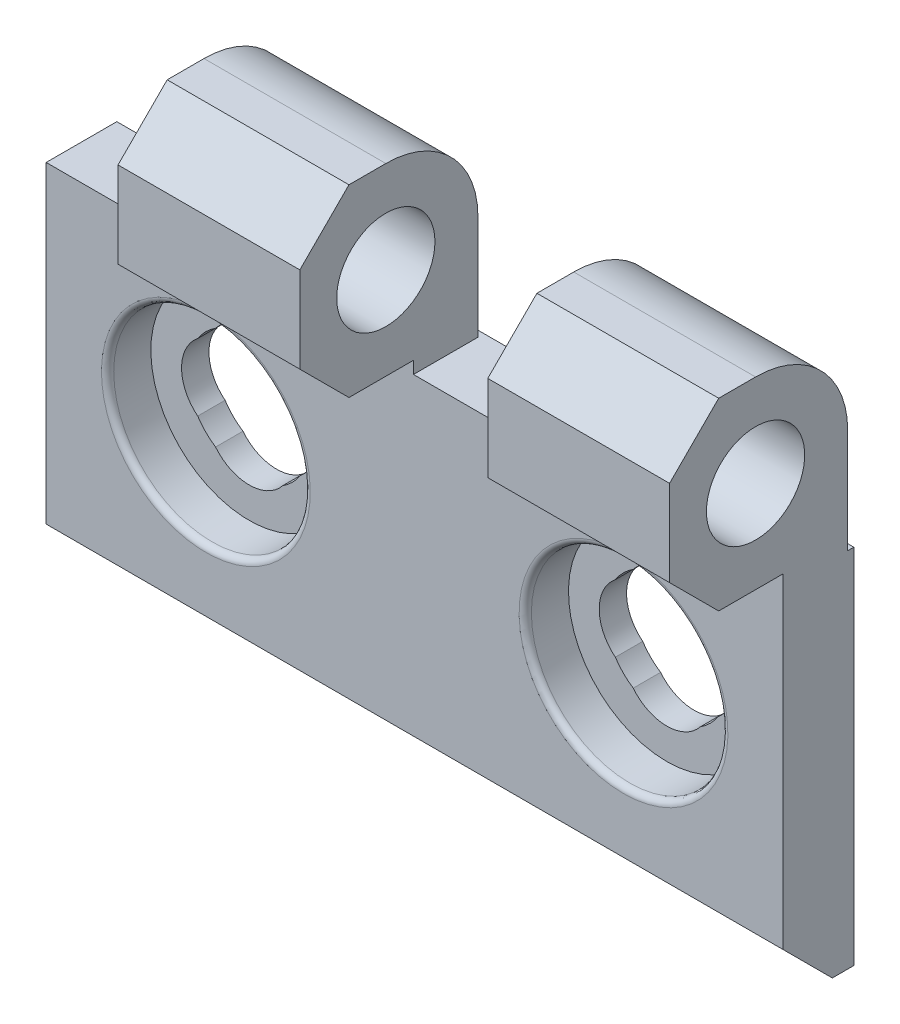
ISO-10303-21;
HEADER;
FILE_DESCRIPTION(('STEP AP214'),'2;1');
FILE_NAME('part.step','',(''),(''),'','','');
FILE_SCHEMA(('AUTOMOTIVE_DESIGN { 1 0 10303 214 1 1 1 1 }'));
ENDSEC;
DATA;
#1=APPLICATION_CONTEXT('core data for automotive mechanical design processes');
#2=APPLICATION_PROTOCOL_DEFINITION('international standard','automotive_design',2000,#1);
#3=PRODUCT_CONTEXT('',#1,'mechanical');
#4=PRODUCT('Part','Part','',(#3));
#5=PRODUCT_RELATED_PRODUCT_CATEGORY('part','',(#4));
#6=PRODUCT_DEFINITION_FORMATION('','',#4);
#7=PRODUCT_DEFINITION_CONTEXT('part definition',#1,'design');
#8=PRODUCT_DEFINITION('design','',#6,#7);
#9=PRODUCT_DEFINITION_SHAPE('','',#8);
#10=(LENGTH_UNIT() NAMED_UNIT(*) SI_UNIT(.MILLI.,.METRE.));
#11=(NAMED_UNIT(*) PLANE_ANGLE_UNIT() SI_UNIT($,.RADIAN.));
#12=(NAMED_UNIT(*) SI_UNIT($,.STERADIAN.) SOLID_ANGLE_UNIT());
#13=UNCERTAINTY_MEASURE_WITH_UNIT(LENGTH_MEASURE(1.E-05),#10,'distance_accuracy_value','');
#14=(GEOMETRIC_REPRESENTATION_CONTEXT(3) GLOBAL_UNCERTAINTY_ASSIGNED_CONTEXT((#13)) GLOBAL_UNIT_ASSIGNED_CONTEXT((#10,
#11,#12)) REPRESENTATION_CONTEXT('',''));
#15=CARTESIAN_POINT('',(0.,0.,0.));
#16=DIRECTION('',(0.,0.,1.));
#17=DIRECTION('',(1.,0.,0.));
#18=AXIS2_PLACEMENT_3D('',#15,#16,#17);
#19=CARTESIAN_POINT('',(0.,0.,5.75));
#20=DIRECTION('',(0.,0.,-1.));
#21=DIRECTION('',(0.,1.,0.));
#22=AXIS2_PLACEMENT_3D('',#19,#20,#21);
#23=CYLINDRICAL_SURFACE('',#22,8.);
#24=CARTESIAN_POINT('',(0.,0.,5.25));
#25=DIRECTION('',(0.,0.,-1.));
#26=DIRECTION('',(1.,0.,0.));
#27=AXIS2_PLACEMENT_3D('',#24,#25,#26);
#28=CIRCLE('',#27,8.);
#29=CARTESIAN_POINT('',(8.,0.,5.25));
#30=VERTEX_POINT('',#29);
#31=EDGE_CURVE('E389',#30,#30,#28,.T.);
#32=ORIENTED_EDGE('',*,*,#31,.F.);
#33=EDGE_LOOP('',(#32));
#34=FACE_BOUND('',#33,.T.);
#35=CARTESIAN_POINT('',(0.,0.,2.22870985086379));
#36=DIRECTION('',(0.,0.,-1.));
#37=DIRECTION('',(0.,1.,0.));
#38=AXIS2_PLACEMENT_3D('',#35,#36,#37);
#39=CIRCLE('',#38,8.);
#40=CARTESIAN_POINT('',(0.,8.,2.22870985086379));
#41=VERTEX_POINT('',#40);
#42=EDGE_CURVE('E18',#41,#41,#39,.F.);
#43=ORIENTED_EDGE('',*,*,#42,.F.);
#44=EDGE_LOOP('',(#43));
#45=FACE_BOUND('',#44,.T.);
#46=ADVANCED_FACE('F14',(#34,#45),#23,.F.);
#47=CARTESIAN_POINT('',(34.,0.,5.75));
#48=DIRECTION('',(0.,0.,1.));
#49=DIRECTION('',(0.,-1.,0.));
#50=AXIS2_PLACEMENT_3D('',#47,#48,#49);
#51=CYLINDRICAL_SURFACE('',#50,8.);
#52=CARTESIAN_POINT('',(34.,0.,5.25));
#53=DIRECTION('',(0.,0.,-1.));
#54=DIRECTION('',(0.,1.,0.));
#55=AXIS2_PLACEMENT_3D('',#52,#53,#54);
#56=CIRCLE('',#55,8.);
#57=CARTESIAN_POINT('',(34.,8.,5.25));
#58=VERTEX_POINT('',#57);
#59=EDGE_CURVE('E421',#58,#58,#56,.T.);
#60=ORIENTED_EDGE('',*,*,#59,.F.);
#61=EDGE_LOOP('',(#60));
#62=FACE_BOUND('',#61,.T.);
#63=CARTESIAN_POINT('',(34.,0.,2.22870985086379));
#64=DIRECTION('',(0.,0.,1.));
#65=DIRECTION('',(0.,-1.,0.));
#66=AXIS2_PLACEMENT_3D('',#63,#64,#65);
#67=CIRCLE('',#66,8.);
#68=CARTESIAN_POINT('',(34.,-8.,2.22870985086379));
#69=VERTEX_POINT('',#68);
#70=EDGE_CURVE('E267',#69,#69,#67,.T.);
#71=ORIENTED_EDGE('',*,*,#70,.F.);
#72=EDGE_LOOP('',(#71));
#73=FACE_BOUND('',#72,.T.);
#74=ADVANCED_FACE('F570',(#62,#73),#51,.F.);
#75=CARTESIAN_POINT('',(-13.,21.,8.));
#76=DIRECTION('',(1.,0.,0.));
#77=DIRECTION('',(0.,0.,1.));
#78=AXIS2_PLACEMENT_3D('',#75,#76,#77);
#79=CYLINDRICAL_SURFACE('',#78,7.5);
#80=DIRECTION('',(1.,0.,0.));
#81=VECTOR('',#80,1.);
#82=CARTESIAN_POINT('',(-13.,21.,0.5));
#83=LINE('',#82,#81);
#84=CARTESIAN_POINT('',(2.1,21.,0.5));
#85=VERTEX_POINT('',#84);
#86=CARTESIAN_POINT('',(16.9,21.,0.5));
#87=VERTEX_POINT('',#86);
#88=EDGE_CURVE('E245',#85,#87,#83,.T.);
#89=ORIENTED_EDGE('',*,*,#88,.F.);
#90=CARTESIAN_POINT('',(2.1,21.,8.));
#91=DIRECTION('',(1.,0.,0.));
#92=DIRECTION('',(0.,0.,1.));
#93=AXIS2_PLACEMENT_3D('',#90,#91,#92);
#94=CIRCLE('',#93,7.5);
#95=CARTESIAN_POINT('',(2.1,28.5,8.));
#96=VERTEX_POINT('',#95);
#97=EDGE_CURVE('E248',#85,#96,#94,.T.);
#98=ORIENTED_EDGE('',*,*,#97,.T.);
#99=DIRECTION('',(1.,0.,0.));
#100=VECTOR('',#99,1.);
#101=CARTESIAN_POINT('',(-13.,28.5,8.));
#102=LINE('',#101,#100);
#103=CARTESIAN_POINT('',(16.9,28.5,8.));
#104=VERTEX_POINT('',#103);
#105=EDGE_CURVE('E387',#104,#96,#102,.F.);
#106=ORIENTED_EDGE('',*,*,#105,.F.);
#107=CARTESIAN_POINT('',(16.9,21.,8.));
#108=DIRECTION('',(1.,0.,0.));
#109=DIRECTION('',(0.,0.,1.));
#110=AXIS2_PLACEMENT_3D('',#107,#108,#109);
#111=CIRCLE('',#110,7.5);
#112=EDGE_CURVE('E251',#104,#87,#111,.F.);
#113=ORIENTED_EDGE('',*,*,#112,.T.);
#114=EDGE_LOOP('',(#89,#98,#106,#113));
#115=FACE_BOUND('',#114,.T.);
#116=ADVANCED_FACE('F247',(#115),#79,.T.);
#117=CARTESIAN_POINT('',(-13.,13.5,11.));
#118=DIRECTION('',(0.,-0.707106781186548,0.707106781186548));
#119=DIRECTION('',(0.,-0.707106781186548,-0.707106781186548));
#120=AXIS2_PLACEMENT_3D('',#117,#118,#119);
#121=PLANE('',#120);
#122=DIRECTION('',(1.,0.,0.));
#123=VECTOR('',#122,1.);
#124=CARTESIAN_POINT('',(-13.,17.5,15.));
#125=LINE('',#124,#123);
#126=CARTESIAN_POINT('',(2.1,17.5,15.));
#127=VERTEX_POINT('',#126);
#128=CARTESIAN_POINT('',(16.9,17.5,15.));
#129=VERTEX_POINT('',#128);
#130=EDGE_CURVE('E404',#127,#129,#125,.T.);
#131=ORIENTED_EDGE('',*,*,#130,.F.);
#132=DIRECTION('',(0.,-0.707106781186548,-0.707106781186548));
#133=VECTOR('',#132,1.);
#134=CARTESIAN_POINT('',(2.1,17.5,15.));
#135=LINE('',#134,#133);
#136=CARTESIAN_POINT('',(2.1,13.5,11.));
#137=VERTEX_POINT('',#136);
#138=EDGE_CURVE('E306',#127,#137,#135,.T.);
#139=ORIENTED_EDGE('',*,*,#138,.T.);
#140=DIRECTION('',(1.,0.,0.));
#141=VECTOR('',#140,1.);
#142=CARTESIAN_POINT('',(-13.,13.5,11.));
#143=LINE('',#142,#141);
#144=CARTESIAN_POINT('',(16.9,13.5,11.));
#145=VERTEX_POINT('',#144);
#146=EDGE_CURVE('E418',#145,#137,#143,.F.);
#147=ORIENTED_EDGE('',*,*,#146,.F.);
#148=DIRECTION('',(0.,0.707106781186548,0.707106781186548));
#149=VECTOR('',#148,1.);
#150=CARTESIAN_POINT('',(16.9,13.5,11.));
#151=LINE('',#150,#149);
#152=EDGE_CURVE('E317',#145,#129,#151,.T.);
#153=ORIENTED_EDGE('',*,*,#152,.T.);
#154=EDGE_LOOP('',(#131,#139,#147,#153));
#155=FACE_BOUND('',#154,.T.);
#156=ADVANCED_FACE('F746',(#155),#121,.T.);
#157=CARTESIAN_POINT('',(-13.,28.5,15.));
#158=DIRECTION('',(0.,0.,1.));
#159=DIRECTION('',(0.,-1.,0.));
#160=AXIS2_PLACEMENT_3D('',#157,#158,#159);
#161=PLANE('',#160);
#162=DIRECTION('',(1.,0.,0.));
#163=VECTOR('',#162,1.);
#164=CARTESIAN_POINT('',(-13.,24.5,15.));
#165=LINE('',#164,#163);
#166=CARTESIAN_POINT('',(2.1,24.5,15.));
#167=VERTEX_POINT('',#166);
#168=CARTESIAN_POINT('',(16.9,24.5,15.));
#169=VERTEX_POINT('',#168);
#170=EDGE_CURVE('E393',#167,#169,#165,.T.);
#171=ORIENTED_EDGE('',*,*,#170,.F.);
#172=DIRECTION('',(0.,-1.,0.));
#173=VECTOR('',#172,1.);
#174=CARTESIAN_POINT('',(2.1,12.5,15.));
#175=LINE('',#174,#173);
#176=EDGE_CURVE('E425',#167,#127,#175,.T.);
#177=ORIENTED_EDGE('',*,*,#176,.T.);
#178=ORIENTED_EDGE('',*,*,#130,.T.);
#179=DIRECTION('',(0.,-1.,0.));
#180=VECTOR('',#179,1.);
#181=CARTESIAN_POINT('',(16.9,28.5,15.));
#182=LINE('',#181,#180);
#183=EDGE_CURVE('E399',#129,#169,#182,.F.);
#184=ORIENTED_EDGE('',*,*,#183,.T.);
#185=EDGE_LOOP('',(#171,#177,#178,#184));
#186=FACE_BOUND('',#185,.T.);
#187=ADVANCED_FACE('F742',(#186),#161,.T.);
#188=CARTESIAN_POINT('',(-13.,24.5,15.));
#189=DIRECTION('',(0.,0.707106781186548,0.707106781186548));
#190=DIRECTION('',(0.,-0.707106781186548,0.707106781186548));
#191=AXIS2_PLACEMENT_3D('',#188,#189,#190);
#192=PLANE('',#191);
#193=DIRECTION('',(1.,0.,0.));
#194=VECTOR('',#193,1.);
#195=CARTESIAN_POINT('',(-13.,28.5,11.));
#196=LINE('',#195,#194);
#197=CARTESIAN_POINT('',(2.1,28.5,11.));
#198=VERTEX_POINT('',#197);
#199=CARTESIAN_POINT('',(16.9,28.5,11.));
#200=VERTEX_POINT('',#199);
#201=EDGE_CURVE('E390',#198,#200,#196,.T.);
#202=ORIENTED_EDGE('',*,*,#201,.F.);
#203=DIRECTION('',(0.,-0.707106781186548,0.707106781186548));
#204=VECTOR('',#203,1.);
#205=CARTESIAN_POINT('',(2.1,28.5,11.));
#206=LINE('',#205,#204);
#207=EDGE_CURVE('E288',#198,#167,#206,.T.);
#208=ORIENTED_EDGE('',*,*,#207,.T.);
#209=ORIENTED_EDGE('',*,*,#170,.T.);
#210=DIRECTION('',(0.,0.707106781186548,-0.707106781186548));
#211=VECTOR('',#210,1.);
#212=CARTESIAN_POINT('',(16.9,24.5,15.));
#213=LINE('',#212,#211);
#214=EDGE_CURVE('E396',#169,#200,#213,.T.);
#215=ORIENTED_EDGE('',*,*,#214,.T.);
#216=EDGE_LOOP('',(#202,#208,#209,#215));
#217=FACE_BOUND('',#216,.T.);
#218=ADVANCED_FACE('F738',(#217),#192,.T.);
#219=CARTESIAN_POINT('',(-13.,28.5,8.));
#220=DIRECTION('',(0.,1.,0.));
#221=DIRECTION('',(0.,0.,1.));
#222=AXIS2_PLACEMENT_3D('',#219,#220,#221);
#223=PLANE('',#222);
#224=ORIENTED_EDGE('',*,*,#105,.T.);
#225=DIRECTION('',(0.,0.,1.));
#226=VECTOR('',#225,1.);
#227=CARTESIAN_POINT('',(2.1,28.5,16.5));
#228=LINE('',#227,#226);
#229=EDGE_CURVE('E266',#96,#198,#228,.T.);
#230=ORIENTED_EDGE('',*,*,#229,.T.);
#231=ORIENTED_EDGE('',*,*,#201,.T.);
#232=DIRECTION('',(0.,0.,-1.));
#233=VECTOR('',#232,1.);
#234=CARTESIAN_POINT('',(16.9,28.5,16.5));
#235=LINE('',#234,#233);
#236=EDGE_CURVE('E398',#200,#104,#235,.T.);
#237=ORIENTED_EDGE('',*,*,#236,.T.);
#238=EDGE_LOOP('',(#224,#230,#231,#237));
#239=FACE_BOUND('',#238,.T.);
#240=ADVANCED_FACE('F734',(#239),#223,.T.);
#241=CARTESIAN_POINT('',(0.,0.,5.25));
#242=DIRECTION('',(0.,0.,-1.));
#243=DIRECTION('',(0.,1.,0.));
#244=AXIS2_PLACEMENT_3D('',#241,#242,#243);
#245=TOROIDAL_SURFACE('',#244,8.5,0.5);
#246=CARTESIAN_POINT('',(0.,0.,5.7499999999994));
#247=DIRECTION('',(0.,0.,-1.));
#248=DIRECTION('',(0.,1.,0.));
#249=AXIS2_PLACEMENT_3D('',#246,#247,#248);
#250=CIRCLE('',#249,8.499999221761);
#251=CARTESIAN_POINT('',(0.,8.499999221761,5.7499999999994));
#252=VERTEX_POINT('',#251);
#253=EDGE_CURVE('E329',#252,#252,#250,.T.);
#254=ORIENTED_EDGE('',*,*,#253,.F.);
#255=EDGE_LOOP('',(#254));
#256=FACE_BOUND('',#255,.T.);
#257=ORIENTED_EDGE('',*,*,#31,.T.);
#258=EDGE_LOOP('',(#257));
#259=FACE_BOUND('',#258,.T.);
#260=ADVANCED_FACE('F737',(#256,#259),#245,.T.);
#261=CARTESIAN_POINT('',(34.,0.,5.25));
#262=DIRECTION('',(0.,0.,1.));
#263=DIRECTION('',(0.,-1.,0.));
#264=AXIS2_PLACEMENT_3D('',#261,#262,#263);
#265=TOROIDAL_SURFACE('',#264,8.5,0.5);
#266=CARTESIAN_POINT('',(34.,0.,5.7499999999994));
#267=DIRECTION('',(0.,0.,1.));
#268=DIRECTION('',(0.,-1.,0.));
#269=AXIS2_PLACEMENT_3D('',#266,#267,#268);
#270=CIRCLE('',#269,8.499999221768);
#271=CARTESIAN_POINT('',(34.,-8.499999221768,5.7499999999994));
#272=VERTEX_POINT('',#271);
#273=EDGE_CURVE('E324',#272,#272,#270,.F.);
#274=ORIENTED_EDGE('',*,*,#273,.F.);
#275=EDGE_LOOP('',(#274));
#276=FACE_BOUND('',#275,.T.);
#277=ORIENTED_EDGE('',*,*,#59,.T.);
#278=EDGE_LOOP('',(#277));
#279=FACE_BOUND('',#278,.T.);
#280=ADVANCED_FACE('F16',(#276,#279),#265,.T.);
#281=CARTESIAN_POINT('',(-13.,13.5,15.));
#282=DIRECTION('',(0.,-1.,0.));
#283=DIRECTION('',(0.,0.,-1.));
#284=AXIS2_PLACEMENT_3D('',#281,#282,#283);
#285=PLANE('',#284);
#286=ORIENTED_EDGE('',*,*,#146,.T.);
#287=DIRECTION('',(0.,0.,1.));
#288=VECTOR('',#287,1.);
#289=CARTESIAN_POINT('',(2.1,13.5,16.5));
#290=LINE('',#289,#288);
#291=CARTESIAN_POINT('',(2.1,13.5,5.75));
#292=VERTEX_POINT('',#291);
#293=EDGE_CURVE('E256',#137,#292,#290,.F.);
#294=ORIENTED_EDGE('',*,*,#293,.T.);
#295=DIRECTION('',(1.,0.,0.));
#296=VECTOR('',#295,1.);
#297=CARTESIAN_POINT('',(-13.,13.5,5.75));
#298=LINE('',#297,#296);
#299=CARTESIAN_POINT('',(16.9,13.5,5.75));
#300=VERTEX_POINT('',#299);
#301=EDGE_CURVE('E295',#300,#292,#298,.F.);
#302=ORIENTED_EDGE('',*,*,#301,.F.);
#303=DIRECTION('',(0.,0.,-1.));
#304=VECTOR('',#303,1.);
#305=CARTESIAN_POINT('',(16.9,13.5,16.5));
#306=LINE('',#305,#304);
#307=EDGE_CURVE('E314',#300,#145,#306,.F.);
#308=ORIENTED_EDGE('',*,*,#307,.T.);
#309=EDGE_LOOP('',(#286,#294,#302,#308));
#310=FACE_BOUND('',#309,.T.);
#311=ADVANCED_FACE('F730',(#310),#285,.T.);
#312=CARTESIAN_POINT('',(0.,0.,2.22870985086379));
#313=DIRECTION('',(0.,0.,1.));
#314=DIRECTION('',(0.,-1.,0.));
#315=AXIS2_PLACEMENT_3D('',#312,#313,#314);
#316=PLANE('',#315);
#317=ORIENTED_EDGE('',*,*,#42,.T.);
#318=EDGE_LOOP('',(#317));
#319=FACE_BOUND('',#318,.T.);
#320=CARTESIAN_POINT('',(2.,0.,2.22870985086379));
#321=DIRECTION('',(0.,0.,-1.));
#322=DIRECTION('',(0.,1.,0.));
#323=AXIS2_PLACEMENT_3D('',#320,#321,#322);
#324=CIRCLE('',#323,3.5);
#325=CARTESIAN_POINT('',(4.1875,2.7321866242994,2.22870985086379));
#326=VERTEX_POINT('',#325);
#327=CARTESIAN_POINT('',(4.1875,-2.7321866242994,2.22870985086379));
#328=VERTEX_POINT('',#327);
#329=EDGE_CURVE('E544',#326,#328,#324,.T.);
#330=ORIENTED_EDGE('',*,*,#329,.T.);
#331=CARTESIAN_POINT('',(0.,0.,2.22870985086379));
#332=DIRECTION('',(0.,0.,1.));
#333=DIRECTION('',(0.,-1.,0.));
#334=AXIS2_PLACEMENT_3D('',#331,#332,#333);
#335=CIRCLE('',#334,5.);
#336=CARTESIAN_POINT('',(2.73218662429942,-4.1875,2.22870985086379));
#337=VERTEX_POINT('',#336);
#338=EDGE_CURVE('E548',#328,#337,#335,.F.);
#339=ORIENTED_EDGE('',*,*,#338,.T.);
#340=CARTESIAN_POINT('',(0.,-2.,2.22870985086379));
#341=DIRECTION('',(0.,0.,-1.));
#342=DIRECTION('',(0.,1.,0.));
#343=AXIS2_PLACEMENT_3D('',#340,#341,#342);
#344=CIRCLE('',#343,3.5);
#345=CARTESIAN_POINT('',(-2.7321866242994,-4.1875,2.22870985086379));
#346=VERTEX_POINT('',#345);
#347=EDGE_CURVE('E552',#337,#346,#344,.T.);
#348=ORIENTED_EDGE('',*,*,#347,.T.);
#349=CARTESIAN_POINT('',(0.,0.,2.22870985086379));
#350=DIRECTION('',(0.,0.,1.));
#351=DIRECTION('',(0.,-1.,0.));
#352=AXIS2_PLACEMENT_3D('',#349,#350,#351);
#353=CIRCLE('',#352,5.);
#354=CARTESIAN_POINT('',(-4.1875,-2.7321866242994,2.22870985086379));
#355=VERTEX_POINT('',#354);
#356=EDGE_CURVE('E524',#346,#355,#353,.F.);
#357=ORIENTED_EDGE('',*,*,#356,.T.);
#358=CARTESIAN_POINT('',(-2.,0.,2.22870985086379));
#359=DIRECTION('',(0.,0.,-1.));
#360=DIRECTION('',(0.,1.,0.));
#361=AXIS2_PLACEMENT_3D('',#358,#359,#360);
#362=CIRCLE('',#361,3.5);
#363=CARTESIAN_POINT('',(-4.1875,2.73218662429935,2.22870985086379));
#364=VERTEX_POINT('',#363);
#365=EDGE_CURVE('E528',#355,#364,#362,.T.);
#366=ORIENTED_EDGE('',*,*,#365,.T.);
#367=CARTESIAN_POINT('',(0.,0.,2.22870985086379));
#368=DIRECTION('',(0.,0.,1.));
#369=DIRECTION('',(0.,-1.,0.));
#370=AXIS2_PLACEMENT_3D('',#367,#368,#369);
#371=CIRCLE('',#370,5.);
#372=CARTESIAN_POINT('',(-2.7321866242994,4.1875,2.22870985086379));
#373=VERTEX_POINT('',#372);
#374=EDGE_CURVE('E533',#364,#373,#371,.F.);
#375=ORIENTED_EDGE('',*,*,#374,.T.);
#376=CARTESIAN_POINT('',(0.,2.,2.22870985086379));
#377=DIRECTION('',(0.,0.,-1.));
#378=DIRECTION('',(0.,1.,0.));
#379=AXIS2_PLACEMENT_3D('',#376,#377,#378);
#380=CIRCLE('',#379,3.5);
#381=CARTESIAN_POINT('',(2.73218662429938,4.1875,2.22870985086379));
#382=VERTEX_POINT('',#381);
#383=EDGE_CURVE('E537',#373,#382,#380,.T.);
#384=ORIENTED_EDGE('',*,*,#383,.T.);
#385=CARTESIAN_POINT('',(0.,0.,2.22870985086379));
#386=DIRECTION('',(0.,0.,1.));
#387=DIRECTION('',(0.,-1.,0.));
#388=AXIS2_PLACEMENT_3D('',#385,#386,#387);
#389=CIRCLE('',#388,5.);
#390=EDGE_CURVE('E540',#382,#326,#389,.F.);
#391=ORIENTED_EDGE('',*,*,#390,.T.);
#392=EDGE_LOOP('',(#330,#339,#348,#357,#366,#375,#384,#391));
#393=FACE_BOUND('',#392,.T.);
#394=ADVANCED_FACE('F566',(#319,#393),#316,.T.);
#395=CARTESIAN_POINT('',(34.,0.,2.22870985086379));
#396=DIRECTION('',(0.,0.,1.));
#397=DIRECTION('',(0.,-1.,0.));
#398=AXIS2_PLACEMENT_3D('',#395,#396,#397);
#399=PLANE('',#398);
#400=CARTESIAN_POINT('',(34.,2.,2.22870985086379));
#401=DIRECTION('',(0.,0.,1.));
#402=DIRECTION('',(0.,-1.,0.));
#403=AXIS2_PLACEMENT_3D('',#400,#401,#402);
#404=CIRCLE('',#403,3.5);
#405=CARTESIAN_POINT('',(31.2678133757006,4.1875,2.22870985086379));
#406=VERTEX_POINT('',#405);
#407=CARTESIAN_POINT('',(36.7321866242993,4.1875,2.22870985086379));
#408=VERTEX_POINT('',#407);
#409=EDGE_CURVE('E506',#406,#408,#404,.F.);
#410=ORIENTED_EDGE('',*,*,#409,.T.);
#411=CARTESIAN_POINT('',(34.,0.,2.22870985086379));
#412=DIRECTION('',(0.,0.,1.));
#413=DIRECTION('',(0.,-1.,0.));
#414=AXIS2_PLACEMENT_3D('',#411,#412,#413);
#415=CIRCLE('',#414,5.);
#416=CARTESIAN_POINT('',(38.1875,2.7321866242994,2.22870985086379));
#417=VERTEX_POINT('',#416);
#418=EDGE_CURVE('E510',#408,#417,#415,.F.);
#419=ORIENTED_EDGE('',*,*,#418,.T.);
#420=CARTESIAN_POINT('',(36.,0.,2.22870985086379));
#421=DIRECTION('',(0.,0.,1.));
#422=DIRECTION('',(0.,-1.,0.));
#423=AXIS2_PLACEMENT_3D('',#420,#421,#422);
#424=CIRCLE('',#423,3.5);
#425=CARTESIAN_POINT('',(38.1875,-2.7321866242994,2.22870985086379));
#426=VERTEX_POINT('',#425);
#427=EDGE_CURVE('E514',#417,#426,#424,.F.);
#428=ORIENTED_EDGE('',*,*,#427,.T.);
#429=CARTESIAN_POINT('',(34.,0.,2.22870985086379));
#430=DIRECTION('',(0.,0.,1.));
#431=DIRECTION('',(0.,-1.,0.));
#432=AXIS2_PLACEMENT_3D('',#429,#430,#431);
#433=CIRCLE('',#432,5.);
#434=CARTESIAN_POINT('',(36.7321866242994,-4.1875,2.22870985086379));
#435=VERTEX_POINT('',#434);
#436=EDGE_CURVE('E518',#426,#435,#433,.F.);
#437=ORIENTED_EDGE('',*,*,#436,.T.);
#438=CARTESIAN_POINT('',(34.,-2.,2.22870985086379));
#439=DIRECTION('',(0.,0.,1.));
#440=DIRECTION('',(0.,-1.,0.));
#441=AXIS2_PLACEMENT_3D('',#438,#439,#440);
#442=CIRCLE('',#441,3.5);
#443=CARTESIAN_POINT('',(31.2678133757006,-4.1875,2.22870985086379));
#444=VERTEX_POINT('',#443);
#445=EDGE_CURVE('E522',#435,#444,#442,.F.);
#446=ORIENTED_EDGE('',*,*,#445,.T.);
#447=CARTESIAN_POINT('',(34.,0.,2.22870985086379));
#448=DIRECTION('',(0.,0.,1.));
#449=DIRECTION('',(0.,-1.,0.));
#450=AXIS2_PLACEMENT_3D('',#447,#448,#449);
#451=CIRCLE('',#450,5.);
#452=CARTESIAN_POINT('',(29.8125,-2.73218662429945,2.22870985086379));
#453=VERTEX_POINT('',#452);
#454=EDGE_CURVE('E492',#444,#453,#451,.F.);
#455=ORIENTED_EDGE('',*,*,#454,.T.);
#456=CARTESIAN_POINT('',(32.,0.,2.22870985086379));
#457=DIRECTION('',(0.,0.,1.));
#458=DIRECTION('',(0.,-1.,0.));
#459=AXIS2_PLACEMENT_3D('',#456,#457,#458);
#460=CIRCLE('',#459,3.5);
#461=CARTESIAN_POINT('',(29.8125,2.73218662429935,2.22870985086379));
#462=VERTEX_POINT('',#461);
#463=EDGE_CURVE('E497',#453,#462,#460,.F.);
#464=ORIENTED_EDGE('',*,*,#463,.T.);
#465=CARTESIAN_POINT('',(34.,0.,2.22870985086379));
#466=DIRECTION('',(0.,0.,1.));
#467=DIRECTION('',(0.,-1.,0.));
#468=AXIS2_PLACEMENT_3D('',#465,#466,#467);
#469=CIRCLE('',#468,5.);
#470=EDGE_CURVE('E502',#462,#406,#469,.F.);
#471=ORIENTED_EDGE('',*,*,#470,.T.);
#472=EDGE_LOOP('',(#410,#419,#428,#437,#446,#455,#464,#471));
#473=FACE_BOUND('',#472,.T.);
#474=ORIENTED_EDGE('',*,*,#70,.T.);
#475=EDGE_LOOP('',(#474));
#476=FACE_BOUND('',#475,.T.);
#477=ADVANCED_FACE('F724',(#473,#476),#399,.T.);
#478=CARTESIAN_POINT('',(2.1,12.5,16.5));
#479=DIRECTION('',(1.,0.,0.));
#480=DIRECTION('',(0.,0.,1.));
#481=AXIS2_PLACEMENT_3D('',#478,#479,#480);
#482=PLANE('',#481);
#483=ORIENTED_EDGE('',*,*,#293,.F.);
#484=ORIENTED_EDGE('',*,*,#138,.F.);
#485=ORIENTED_EDGE('',*,*,#176,.F.);
#486=ORIENTED_EDGE('',*,*,#207,.F.);
#487=ORIENTED_EDGE('',*,*,#229,.F.);
#488=ORIENTED_EDGE('',*,*,#97,.F.);
#489=DIRECTION('',(0.,1.,0.));
#490=VECTOR('',#489,1.);
#491=CARTESIAN_POINT('',(2.1,12.5,0.5));
#492=LINE('',#491,#490);
#493=CARTESIAN_POINT('',(2.1,12.5,0.5));
#494=VERTEX_POINT('',#493);
#495=EDGE_CURVE('E255',#494,#85,#492,.T.);
#496=ORIENTED_EDGE('',*,*,#495,.F.);
#497=DIRECTION('',(0.,0.,1.));
#498=VECTOR('',#497,1.);
#499=CARTESIAN_POINT('',(2.1,12.5,0.));
#500=LINE('',#499,#498);
#501=CARTESIAN_POINT('',(2.1,12.5,5.75));
#502=VERTEX_POINT('',#501);
#503=EDGE_CURVE('E282',#502,#494,#500,.F.);
#504=ORIENTED_EDGE('',*,*,#503,.F.);
#505=DIRECTION('',(0.,-1.,0.));
#506=VECTOR('',#505,1.);
#507=CARTESIAN_POINT('',(2.1,13.5,5.75));
#508=LINE('',#507,#506);
#509=EDGE_CURVE('E291',#292,#502,#508,.T.);
#510=ORIENTED_EDGE('',*,*,#509,.F.);
#511=EDGE_LOOP('',(#483,#484,#485,#486,#487,#488,#496,#504,#510));
#512=FACE_BOUND('',#511,.T.);
#513=CARTESIAN_POINT('',(2.1,21.,8.));
#514=DIRECTION('',(-1.,0.,0.));
#515=DIRECTION('',(0.,0.,-1.));
#516=AXIS2_PLACEMENT_3D('',#513,#514,#515);
#517=CIRCLE('',#516,4.);
#518=CARTESIAN_POINT('',(2.1,21.,4.));
#519=VERTEX_POINT('',#518);
#520=EDGE_CURVE('E1053',#519,#519,#517,.T.);
#521=ORIENTED_EDGE('',*,*,#520,.F.);
#522=EDGE_LOOP('',(#521));
#523=FACE_BOUND('',#522,.T.);
#524=ADVANCED_FACE('F261',(#512,#523),#482,.F.);
#525=CARTESIAN_POINT('',(-13.,12.5,0.5));
#526=DIRECTION('',(0.,0.,-1.));
#527=DIRECTION('',(0.,1.,0.));
#528=AXIS2_PLACEMENT_3D('',#525,#526,#527);
#529=PLANE('',#528);
#530=DIRECTION('',(1.,0.,0.));
#531=VECTOR('',#530,1.);
#532=CARTESIAN_POINT('',(-13.,12.5,0.5));
#533=LINE('',#532,#531);
#534=CARTESIAN_POINT('',(16.9,12.5,0.5));
#535=VERTEX_POINT('',#534);
#536=EDGE_CURVE('E271',#494,#535,#533,.T.);
#537=ORIENTED_EDGE('',*,*,#536,.F.);
#538=ORIENTED_EDGE('',*,*,#495,.T.);
#539=ORIENTED_EDGE('',*,*,#88,.T.);
#540=DIRECTION('',(0.,-1.,0.));
#541=VECTOR('',#540,1.);
#542=CARTESIAN_POINT('',(16.9,28.5,0.5));
#543=LINE('',#542,#541);
#544=EDGE_CURVE('E274',#87,#535,#543,.T.);
#545=ORIENTED_EDGE('',*,*,#544,.T.);
#546=EDGE_LOOP('',(#537,#538,#539,#545));
#547=FACE_BOUND('',#546,.T.);
#548=ADVANCED_FACE('F269',(#547),#529,.T.);
#549=CARTESIAN_POINT('',(16.9,28.5,16.5));
#550=DIRECTION('',(-1.,0.,0.));
#551=DIRECTION('',(0.,0.,-1.));
#552=AXIS2_PLACEMENT_3D('',#549,#550,#551);
#553=PLANE('',#552);
#554=ORIENTED_EDGE('',*,*,#214,.F.);
#555=ORIENTED_EDGE('',*,*,#183,.F.);
#556=ORIENTED_EDGE('',*,*,#152,.F.);
#557=ORIENTED_EDGE('',*,*,#307,.F.);
#558=DIRECTION('',(0.,-1.,0.));
#559=VECTOR('',#558,1.);
#560=CARTESIAN_POINT('',(16.9,13.5,5.75));
#561=LINE('',#560,#559);
#562=CARTESIAN_POINT('',(16.9,12.5,5.75));
#563=VERTEX_POINT('',#562);
#564=EDGE_CURVE('E311',#563,#300,#561,.F.);
#565=ORIENTED_EDGE('',*,*,#564,.F.);
#566=DIRECTION('',(0.,0.,1.));
#567=VECTOR('',#566,1.);
#568=CARTESIAN_POINT('',(16.9,12.5,0.));
#569=LINE('',#568,#567);
#570=EDGE_CURVE('E1149',#535,#563,#569,.T.);
#571=ORIENTED_EDGE('',*,*,#570,.F.);
#572=ORIENTED_EDGE('',*,*,#544,.F.);
#573=ORIENTED_EDGE('',*,*,#112,.F.);
#574=ORIENTED_EDGE('',*,*,#236,.F.);
#575=EDGE_LOOP('',(#554,#555,#556,#557,#565,#571,#572,#573,#574));
#576=FACE_BOUND('',#575,.T.);
#577=CARTESIAN_POINT('',(16.9,21.,8.));
#578=DIRECTION('',(-1.,0.,0.));
#579=DIRECTION('',(0.,0.,-1.));
#580=AXIS2_PLACEMENT_3D('',#577,#578,#579);
#581=CIRCLE('',#580,4.);
#582=CARTESIAN_POINT('',(16.9,21.,4.));
#583=VERTEX_POINT('',#582);
#584=EDGE_CURVE('E1050',#583,#583,#581,.F.);
#585=ORIENTED_EDGE('',*,*,#584,.F.);
#586=EDGE_LOOP('',(#585));
#587=FACE_BOUND('',#586,.T.);
#588=ADVANCED_FACE('F715',(#576,#587),#553,.F.);
#589=CARTESIAN_POINT('',(32.2,12.5,16.5));
#590=DIRECTION('',(1.,0.,0.));
#591=DIRECTION('',(0.,0.,1.));
#592=AXIS2_PLACEMENT_3D('',#589,#590,#591);
#593=PLANE('',#592);
#594=DIRECTION('',(0.,0.,-1.));
#595=VECTOR('',#594,1.);
#596=CARTESIAN_POINT('',(32.2,13.5,15.));
#597=LINE('',#596,#595);
#598=CARTESIAN_POINT('',(32.2,13.5,11.));
#599=VERTEX_POINT('',#598);
#600=CARTESIAN_POINT('',(32.2,13.5,5.75));
#601=VERTEX_POINT('',#600);
#602=EDGE_CURVE('E327',#599,#601,#597,.T.);
#603=ORIENTED_EDGE('',*,*,#602,.F.);
#604=DIRECTION('',(0.,-0.707106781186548,-0.707106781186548));
#605=VECTOR('',#604,1.);
#606=CARTESIAN_POINT('',(32.2,13.5,11.));
#607=LINE('',#606,#605);
#608=CARTESIAN_POINT('',(32.2,17.5,15.));
#609=VERTEX_POINT('',#608);
#610=EDGE_CURVE('E347',#609,#599,#607,.T.);
#611=ORIENTED_EDGE('',*,*,#610,.F.);
#612=DIRECTION('',(0.,-1.,0.));
#613=VECTOR('',#612,1.);
#614=CARTESIAN_POINT('',(32.2,28.5,15.));
#615=LINE('',#614,#613);
#616=CARTESIAN_POINT('',(32.2,24.5,15.));
#617=VERTEX_POINT('',#616);
#618=EDGE_CURVE('E361',#617,#609,#615,.T.);
#619=ORIENTED_EDGE('',*,*,#618,.F.);
#620=DIRECTION('',(0.,-0.707106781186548,0.707106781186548));
#621=VECTOR('',#620,1.);
#622=CARTESIAN_POINT('',(32.2,24.5,15.));
#623=LINE('',#622,#621);
#624=CARTESIAN_POINT('',(32.2,28.5,11.));
#625=VERTEX_POINT('',#624);
#626=EDGE_CURVE('E375',#625,#617,#623,.T.);
#627=ORIENTED_EDGE('',*,*,#626,.F.);
#628=DIRECTION('',(0.,0.,1.));
#629=VECTOR('',#628,1.);
#630=CARTESIAN_POINT('',(32.2,28.5,8.));
#631=LINE('',#630,#629);
#632=CARTESIAN_POINT('',(32.2,28.5,8.));
#633=VERTEX_POINT('',#632);
#634=EDGE_CURVE('E382',#633,#625,#631,.T.);
#635=ORIENTED_EDGE('',*,*,#634,.F.);
#636=CARTESIAN_POINT('',(32.2,21.,8.));
#637=DIRECTION('',(1.,0.,0.));
#638=DIRECTION('',(0.,0.,1.));
#639=AXIS2_PLACEMENT_3D('',#636,#637,#638);
#640=CIRCLE('',#639,7.5);
#641=CARTESIAN_POINT('',(32.2,21.,0.5));
#642=VERTEX_POINT('',#641);
#643=EDGE_CURVE('E558',#642,#633,#640,.T.);
#644=ORIENTED_EDGE('',*,*,#643,.F.);
#645=DIRECTION('',(0.,1.,0.));
#646=VECTOR('',#645,1.);
#647=CARTESIAN_POINT('',(32.2,12.5,0.5));
#648=LINE('',#647,#646);
#649=CARTESIAN_POINT('',(32.2,12.5,0.5));
#650=VERTEX_POINT('',#649);
#651=EDGE_CURVE('E1126',#650,#642,#648,.T.);
#652=ORIENTED_EDGE('',*,*,#651,.F.);
#653=DIRECTION('',(0.,0.,1.));
#654=VECTOR('',#653,1.);
#655=CARTESIAN_POINT('',(32.2,12.5,0.));
#656=LINE('',#655,#654);
#657=CARTESIAN_POINT('',(32.2,12.5,5.75));
#658=VERTEX_POINT('',#657);
#659=EDGE_CURVE('E1131',#658,#650,#656,.F.);
#660=ORIENTED_EDGE('',*,*,#659,.F.);
#661=DIRECTION('',(0.,-1.,0.));
#662=VECTOR('',#661,1.);
#663=CARTESIAN_POINT('',(32.2,13.5,5.75));
#664=LINE('',#663,#662);
#665=EDGE_CURVE('E323',#601,#658,#664,.T.);
#666=ORIENTED_EDGE('',*,*,#665,.F.);
#667=EDGE_LOOP('',(#603,#611,#619,#627,#635,#644,#652,#660,#666));
#668=FACE_BOUND('',#667,.T.);
#669=CARTESIAN_POINT('',(32.2,21.,8.));
#670=DIRECTION('',(1.,0.,0.));
#671=DIRECTION('',(0.,0.,1.));
#672=AXIS2_PLACEMENT_3D('',#669,#670,#671);
#673=CIRCLE('',#672,4.);
#674=CARTESIAN_POINT('',(32.2,21.,12.));
#675=VERTEX_POINT('',#674);
#676=EDGE_CURVE('E412',#675,#675,#673,.F.);
#677=ORIENTED_EDGE('',*,*,#676,.F.);
#678=EDGE_LOOP('',(#677));
#679=FACE_BOUND('',#678,.T.);
#680=ADVANCED_FACE('F711',(#668,#679),#593,.F.);
#681=CARTESIAN_POINT('',(-13.,12.5,0.5));
#682=DIRECTION('',(0.,0.,-1.));
#683=DIRECTION('',(0.,1.,0.));
#684=AXIS2_PLACEMENT_3D('',#681,#682,#683);
#685=PLANE('',#684);
#686=DIRECTION('',(1.,0.,0.));
#687=VECTOR('',#686,1.);
#688=CARTESIAN_POINT('',(-13.,21.,0.5));
#689=LINE('',#688,#687);
#690=CARTESIAN_POINT('',(47.,21.,0.5));
#691=VERTEX_POINT('',#690);
#692=EDGE_CURVE('E559',#691,#642,#689,.F.);
#693=ORIENTED_EDGE('',*,*,#692,.F.);
#694=DIRECTION('',(0.,-1.,0.));
#695=VECTOR('',#694,1.);
#696=CARTESIAN_POINT('',(47.,21.,0.5));
#697=LINE('',#696,#695);
#698=CARTESIAN_POINT('',(47.,12.5,0.5));
#699=VERTEX_POINT('',#698);
#700=EDGE_CURVE('E491',#699,#691,#697,.F.);
#701=ORIENTED_EDGE('',*,*,#700,.F.);
#702=DIRECTION('',(1.,0.,0.));
#703=VECTOR('',#702,1.);
#704=CARTESIAN_POINT('',(-13.,12.5,0.5));
#705=LINE('',#704,#703);
#706=EDGE_CURVE('E1081',#650,#699,#705,.T.);
#707=ORIENTED_EDGE('',*,*,#706,.F.);
#708=ORIENTED_EDGE('',*,*,#651,.T.);
#709=EDGE_LOOP('',(#693,#701,#707,#708));
#710=FACE_BOUND('',#709,.T.);
#711=ADVANCED_FACE('F707',(#710),#685,.T.);
#712=CARTESIAN_POINT('',(-13.,21.,8.));
#713=DIRECTION('',(1.,0.,0.));
#714=DIRECTION('',(0.,0.,1.));
#715=AXIS2_PLACEMENT_3D('',#712,#713,#714);
#716=CYLINDRICAL_SURFACE('',#715,7.5);
#717=DIRECTION('',(1.,0.,0.));
#718=VECTOR('',#717,1.);
#719=CARTESIAN_POINT('',(-13.,28.5,8.));
#720=LINE('',#719,#718);
#721=CARTESIAN_POINT('',(47.,28.5,8.));
#722=VERTEX_POINT('',#721);
#723=EDGE_CURVE('E384',#722,#633,#720,.F.);
#724=ORIENTED_EDGE('',*,*,#723,.F.);
#725=CARTESIAN_POINT('',(47.,21.,8.));
#726=DIRECTION('',(1.,0.,0.));
#727=DIRECTION('',(0.,0.,1.));
#728=AXIS2_PLACEMENT_3D('',#725,#726,#727);
#729=CIRCLE('',#728,7.5);
#730=EDGE_CURVE('E487',#691,#722,#729,.T.);
#731=ORIENTED_EDGE('',*,*,#730,.F.);
#732=ORIENTED_EDGE('',*,*,#692,.T.);
#733=ORIENTED_EDGE('',*,*,#643,.T.);
#734=EDGE_LOOP('',(#724,#731,#732,#733));
#735=FACE_BOUND('',#734,.T.);
#736=ADVANCED_FACE('F703',(#735),#716,.T.);
#737=CARTESIAN_POINT('',(-13.,28.5,8.));
#738=DIRECTION('',(0.,1.,0.));
#739=DIRECTION('',(0.,0.,1.));
#740=AXIS2_PLACEMENT_3D('',#737,#738,#739);
#741=PLANE('',#740);
#742=DIRECTION('',(1.,0.,0.));
#743=VECTOR('',#742,1.);
#744=CARTESIAN_POINT('',(-13.,28.5,11.));
#745=LINE('',#744,#743);
#746=CARTESIAN_POINT('',(47.,28.5,11.));
#747=VERTEX_POINT('',#746);
#748=EDGE_CURVE('E379',#747,#625,#745,.F.);
#749=ORIENTED_EDGE('',*,*,#748,.F.);
#750=DIRECTION('',(0.,0.,1.));
#751=VECTOR('',#750,1.);
#752=CARTESIAN_POINT('',(47.,28.5,8.));
#753=LINE('',#752,#751);
#754=EDGE_CURVE('E490',#722,#747,#753,.T.);
#755=ORIENTED_EDGE('',*,*,#754,.F.);
#756=ORIENTED_EDGE('',*,*,#723,.T.);
#757=ORIENTED_EDGE('',*,*,#634,.T.);
#758=EDGE_LOOP('',(#749,#755,#756,#757));
#759=FACE_BOUND('',#758,.T.);
#760=ADVANCED_FACE('F699',(#759),#741,.T.);
#761=CARTESIAN_POINT('',(-13.,24.5,15.));
#762=DIRECTION('',(0.,0.707106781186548,0.707106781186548));
#763=DIRECTION('',(0.,-0.707106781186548,0.707106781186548));
#764=AXIS2_PLACEMENT_3D('',#761,#762,#763);
#765=PLANE('',#764);
#766=DIRECTION('',(1.,0.,0.));
#767=VECTOR('',#766,1.);
#768=CARTESIAN_POINT('',(-13.,24.5,15.));
#769=LINE('',#768,#767);
#770=CARTESIAN_POINT('',(47.,24.5,15.));
#771=VERTEX_POINT('',#770);
#772=EDGE_CURVE('E365',#771,#617,#769,.F.);
#773=ORIENTED_EDGE('',*,*,#772,.F.);
#774=DIRECTION('',(0.,-0.707106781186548,0.707106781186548));
#775=VECTOR('',#774,1.);
#776=CARTESIAN_POINT('',(47.,28.5,11.));
#777=LINE('',#776,#775);
#778=EDGE_CURVE('E370',#747,#771,#777,.T.);
#779=ORIENTED_EDGE('',*,*,#778,.F.);
#780=ORIENTED_EDGE('',*,*,#748,.T.);
#781=ORIENTED_EDGE('',*,*,#626,.T.);
#782=EDGE_LOOP('',(#773,#779,#780,#781));
#783=FACE_BOUND('',#782,.T.);
#784=ADVANCED_FACE('F695',(#783),#765,.T.);
#785=CARTESIAN_POINT('',(-13.,28.5,15.));
#786=DIRECTION('',(0.,0.,1.));
#787=DIRECTION('',(0.,-1.,0.));
#788=AXIS2_PLACEMENT_3D('',#785,#786,#787);
#789=PLANE('',#788);
#790=DIRECTION('',(1.,0.,0.));
#791=VECTOR('',#790,1.);
#792=CARTESIAN_POINT('',(-13.,17.5,15.));
#793=LINE('',#792,#791);
#794=CARTESIAN_POINT('',(47.,17.5,15.));
#795=VERTEX_POINT('',#794);
#796=EDGE_CURVE('E351',#795,#609,#793,.F.);
#797=ORIENTED_EDGE('',*,*,#796,.F.);
#798=DIRECTION('',(0.,-1.,0.));
#799=VECTOR('',#798,1.);
#800=CARTESIAN_POINT('',(47.,21.,15.));
#801=LINE('',#800,#799);
#802=EDGE_CURVE('E356',#771,#795,#801,.T.);
#803=ORIENTED_EDGE('',*,*,#802,.F.);
#804=ORIENTED_EDGE('',*,*,#772,.T.);
#805=ORIENTED_EDGE('',*,*,#618,.T.);
#806=EDGE_LOOP('',(#797,#803,#804,#805));
#807=FACE_BOUND('',#806,.T.);
#808=ADVANCED_FACE('F691',(#807),#789,.T.);
#809=CARTESIAN_POINT('',(-13.,13.5,11.));
#810=DIRECTION('',(0.,-0.707106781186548,0.707106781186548));
#811=DIRECTION('',(0.,-0.707106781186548,-0.707106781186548));
#812=AXIS2_PLACEMENT_3D('',#809,#810,#811);
#813=PLANE('',#812);
#814=DIRECTION('',(1.,0.,0.));
#815=VECTOR('',#814,1.);
#816=CARTESIAN_POINT('',(-13.,13.5,11.));
#817=LINE('',#816,#815);
#818=CARTESIAN_POINT('',(47.,13.5,11.));
#819=VERTEX_POINT('',#818);
#820=EDGE_CURVE('E330',#819,#599,#817,.F.);
#821=ORIENTED_EDGE('',*,*,#820,.F.);
#822=DIRECTION('',(0.,-0.707106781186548,-0.707106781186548));
#823=VECTOR('',#822,1.);
#824=CARTESIAN_POINT('',(47.,17.5,15.));
#825=LINE('',#824,#823);
#826=EDGE_CURVE('E342',#795,#819,#825,.T.);
#827=ORIENTED_EDGE('',*,*,#826,.F.);
#828=ORIENTED_EDGE('',*,*,#796,.T.);
#829=ORIENTED_EDGE('',*,*,#610,.T.);
#830=EDGE_LOOP('',(#821,#827,#828,#829));
#831=FACE_BOUND('',#830,.T.);
#832=ADVANCED_FACE('F687',(#831),#813,.T.);
#833=CARTESIAN_POINT('',(-13.,13.5,15.));
#834=DIRECTION('',(0.,-1.,0.));
#835=DIRECTION('',(0.,0.,-1.));
#836=AXIS2_PLACEMENT_3D('',#833,#834,#835);
#837=PLANE('',#836);
#838=DIRECTION('',(1.,0.,0.));
#839=VECTOR('',#838,1.);
#840=CARTESIAN_POINT('',(-13.,13.5,5.75));
#841=LINE('',#840,#839);
#842=CARTESIAN_POINT('',(47.,13.5,5.75));
#843=VERTEX_POINT('',#842);
#844=EDGE_CURVE('E320',#843,#601,#841,.F.);
#845=ORIENTED_EDGE('',*,*,#844,.F.);
#846=DIRECTION('',(0.,0.,1.));
#847=VECTOR('',#846,1.);
#848=CARTESIAN_POINT('',(47.,13.5,8.));
#849=LINE('',#848,#847);
#850=EDGE_CURVE('E337',#819,#843,#849,.F.);
#851=ORIENTED_EDGE('',*,*,#850,.F.);
#852=ORIENTED_EDGE('',*,*,#820,.T.);
#853=ORIENTED_EDGE('',*,*,#602,.T.);
#854=EDGE_LOOP('',(#845,#851,#852,#853));
#855=FACE_BOUND('',#854,.T.);
#856=ADVANCED_FACE('F683',(#855),#837,.T.);
#857=CARTESIAN_POINT('',(-13.,13.5,5.75));
#858=DIRECTION('',(0.,0.,1.));
#859=DIRECTION('',(0.,-1.,0.));
#860=AXIS2_PLACEMENT_3D('',#857,#858,#859);
#861=PLANE('',#860);
#862=DIRECTION('',(1.,0.,0.));
#863=VECTOR('',#862,1.);
#864=CARTESIAN_POINT('',(-13.,-13.,5.75));
#865=LINE('',#864,#863);
#866=CARTESIAN_POINT('',(47.,-13.,5.75));
#867=VERTEX_POINT('',#866);
#868=CARTESIAN_POINT('',(-13.,-13.,5.75));
#869=VERTEX_POINT('',#868);
#870=EDGE_CURVE('E294',#867,#869,#865,.F.);
#871=ORIENTED_EDGE('',*,*,#870,.F.);
#872=DIRECTION('',(0.,-1.,0.));
#873=VECTOR('',#872,1.);
#874=CARTESIAN_POINT('',(47.,21.,5.75));
#875=LINE('',#874,#873);
#876=EDGE_CURVE('E333',#843,#867,#875,.T.);
#877=ORIENTED_EDGE('',*,*,#876,.F.);
#878=ORIENTED_EDGE('',*,*,#844,.T.);
#879=ORIENTED_EDGE('',*,*,#665,.T.);
#880=DIRECTION('',(1.,0.,0.));
#881=VECTOR('',#880,1.);
#882=CARTESIAN_POINT('',(-13.,12.5,5.75));
#883=LINE('',#882,#881);
#884=EDGE_CURVE('E1144',#563,#658,#883,.T.);
#885=ORIENTED_EDGE('',*,*,#884,.F.);
#886=ORIENTED_EDGE('',*,*,#564,.T.);
#887=ORIENTED_EDGE('',*,*,#301,.T.);
#888=ORIENTED_EDGE('',*,*,#509,.T.);
#889=DIRECTION('',(1.,0.,0.));
#890=VECTOR('',#889,1.);
#891=CARTESIAN_POINT('',(-13.,12.5,5.75));
#892=LINE('',#891,#890);
#893=CARTESIAN_POINT('',(-13.,12.5,5.75));
#894=VERTEX_POINT('',#893);
#895=EDGE_CURVE('E298',#894,#502,#892,.T.);
#896=ORIENTED_EDGE('',*,*,#895,.F.);
#897=DIRECTION('',(0.,-1.,0.));
#898=VECTOR('',#897,1.);
#899=CARTESIAN_POINT('',(-13.,21.,5.75));
#900=LINE('',#899,#898);
#901=EDGE_CURVE('E1087',#894,#869,#900,.T.);
#902=ORIENTED_EDGE('',*,*,#901,.T.);
#903=EDGE_LOOP('',(#871,#877,#878,#879,#885,#886,#887,#888,#896,#902));
#904=FACE_BOUND('',#903,.T.);
#905=ORIENTED_EDGE('',*,*,#273,.T.);
#906=EDGE_LOOP('',(#905));
#907=FACE_BOUND('',#906,.T.);
#908=ORIENTED_EDGE('',*,*,#253,.T.);
#909=EDGE_LOOP('',(#908));
#910=FACE_BOUND('',#909,.T.);
#911=ADVANCED_FACE('F679',(#904,#907,#910),#861,.T.);
#912=CARTESIAN_POINT('',(-13.,-17.,1.75));
#913=DIRECTION('',(0.,-0.707106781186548,0.707106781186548));
#914=DIRECTION('',(0.,-0.707106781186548,-0.707106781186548));
#915=AXIS2_PLACEMENT_3D('',#912,#913,#914);
#916=PLANE('',#915);
#917=DIRECTION('',(0.,-0.707106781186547,-0.707106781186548));
#918=VECTOR('',#917,1.);
#919=CARTESIAN_POINT('',(47.,-13.,5.75));
#920=LINE('',#919,#918);
#921=CARTESIAN_POINT('',(47.,-17.,1.75));
#922=VERTEX_POINT('',#921);
#923=EDGE_CURVE('E336',#867,#922,#920,.T.);
#924=ORIENTED_EDGE('',*,*,#923,.F.);
#925=ORIENTED_EDGE('',*,*,#870,.T.);
#926=DIRECTION('',(0.,-0.707106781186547,-0.707106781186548));
#927=VECTOR('',#926,1.);
#928=CARTESIAN_POINT('',(-13.,-13.,5.75));
#929=LINE('',#928,#927);
#930=CARTESIAN_POINT('',(-13.,-17.,1.75));
#931=VERTEX_POINT('',#930);
#932=EDGE_CURVE('E1084',#869,#931,#929,.T.);
#933=ORIENTED_EDGE('',*,*,#932,.T.);
#934=DIRECTION('',(1.,0.,0.));
#935=VECTOR('',#934,1.);
#936=CARTESIAN_POINT('',(-13.,-17.,1.75));
#937=LINE('',#936,#935);
#938=EDGE_CURVE('E495',#922,#931,#937,.F.);
#939=ORIENTED_EDGE('',*,*,#938,.F.);
#940=EDGE_LOOP('',(#924,#925,#933,#939));
#941=FACE_BOUND('',#940,.T.);
#942=ADVANCED_FACE('F675',(#941),#916,.T.);
#943=CARTESIAN_POINT('',(0.,-2.,5.75));
#944=DIRECTION('',(0.,0.,-1.));
#945=DIRECTION('',(0.,1.,0.));
#946=AXIS2_PLACEMENT_3D('',#943,#944,#945);
#947=CYLINDRICAL_SURFACE('',#946,3.5);
#948=ORIENTED_EDGE('',*,*,#347,.F.);
#949=DIRECTION('',(0.,0.,1.));
#950=VECTOR('',#949,1.);
#951=CARTESIAN_POINT('',(2.73218662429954,-4.1875,16.5));
#952=LINE('',#951,#950);
#953=CARTESIAN_POINT('',(2.73218662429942,-4.1875,0.));
#954=VERTEX_POINT('',#953);
#955=EDGE_CURVE('E551',#337,#954,#952,.F.);
#956=ORIENTED_EDGE('',*,*,#955,.T.);
#957=CARTESIAN_POINT('',(0.,-2.,0.));
#958=DIRECTION('',(0.,0.,-1.));
#959=DIRECTION('',(0.,1.,0.));
#960=AXIS2_PLACEMENT_3D('',#957,#958,#959);
#961=CIRCLE('',#960,3.5);
#962=CARTESIAN_POINT('',(-2.7321866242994,-4.1875,0.));
#963=VERTEX_POINT('',#962);
#964=EDGE_CURVE('E484',#963,#954,#961,.F.);
#965=ORIENTED_EDGE('',*,*,#964,.F.);
#966=DIRECTION('',(0.,0.,1.));
#967=VECTOR('',#966,1.);
#968=CARTESIAN_POINT('',(-2.7321866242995,-4.1875,16.5));
#969=LINE('',#968,#967);
#970=EDGE_CURVE('E527',#963,#346,#969,.T.);
#971=ORIENTED_EDGE('',*,*,#970,.T.);
#972=EDGE_LOOP('',(#948,#956,#965,#971));
#973=FACE_BOUND('',#972,.T.);
#974=ADVANCED_FACE('F671',(#973),#947,.F.);
#975=CARTESIAN_POINT('',(0.,0.,16.5));
#976=DIRECTION('',(0.,0.,1.));
#977=DIRECTION('',(0.,-1.,0.));
#978=AXIS2_PLACEMENT_3D('',#975,#976,#977);
#979=CYLINDRICAL_SURFACE('',#978,5.);
#980=DIRECTION('',(0.,0.,-1.));
#981=VECTOR('',#980,1.);
#982=CARTESIAN_POINT('',(4.18749999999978,-2.7321866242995,5.75));
#983=LINE('',#982,#981);
#984=CARTESIAN_POINT('',(4.1875,-2.7321866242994,0.));
#985=VERTEX_POINT('',#984);
#986=EDGE_CURVE('E547',#328,#985,#983,.T.);
#987=ORIENTED_EDGE('',*,*,#986,.T.);
#988=CARTESIAN_POINT('',(0.,0.,0.));
#989=DIRECTION('',(0.,0.,1.));
#990=DIRECTION('',(0.,-1.,0.));
#991=AXIS2_PLACEMENT_3D('',#988,#989,#990);
#992=CIRCLE('',#991,5.);
#993=EDGE_CURVE('E481',#954,#985,#992,.T.);
#994=ORIENTED_EDGE('',*,*,#993,.F.);
#995=ORIENTED_EDGE('',*,*,#955,.F.);
#996=ORIENTED_EDGE('',*,*,#338,.F.);
#997=EDGE_LOOP('',(#987,#994,#995,#996));
#998=FACE_BOUND('',#997,.T.);
#999=ADVANCED_FACE('F667',(#998),#979,.F.);
#1000=CARTESIAN_POINT('',(2.,0.,5.75));
#1001=DIRECTION('',(0.,0.,-1.));
#1002=DIRECTION('',(0.,1.,0.));
#1003=AXIS2_PLACEMENT_3D('',#1000,#1001,#1002);
#1004=CYLINDRICAL_SURFACE('',#1003,3.5);
#1005=DIRECTION('',(0.,0.,1.));
#1006=VECTOR('',#1005,1.);
#1007=CARTESIAN_POINT('',(4.18749999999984,2.73218662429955,16.5));
#1008=LINE('',#1007,#1006);
#1009=CARTESIAN_POINT('',(4.1875,2.7321866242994,0.));
#1010=VERTEX_POINT('',#1009);
#1011=EDGE_CURVE('E543',#326,#1010,#1008,.F.);
#1012=ORIENTED_EDGE('',*,*,#1011,.T.);
#1013=CARTESIAN_POINT('',(2.,0.,0.));
#1014=DIRECTION('',(0.,0.,-1.));
#1015=DIRECTION('',(0.,1.,0.));
#1016=AXIS2_PLACEMENT_3D('',#1013,#1014,#1015);
#1017=CIRCLE('',#1016,3.5);
#1018=EDGE_CURVE('E478',#985,#1010,#1017,.F.);
#1019=ORIENTED_EDGE('',*,*,#1018,.F.);
#1020=ORIENTED_EDGE('',*,*,#986,.F.);
#1021=ORIENTED_EDGE('',*,*,#329,.F.);
#1022=EDGE_LOOP('',(#1012,#1019,#1020,#1021));
#1023=FACE_BOUND('',#1022,.T.);
#1024=ADVANCED_FACE('F663',(#1023),#1004,.F.);
#1025=CARTESIAN_POINT('',(0.,0.,16.5));
#1026=DIRECTION('',(0.,0.,1.));
#1027=DIRECTION('',(0.,-1.,0.));
#1028=AXIS2_PLACEMENT_3D('',#1025,#1026,#1027);
#1029=CYLINDRICAL_SURFACE('',#1028,5.);
#1030=DIRECTION('',(0.,0.,-1.));
#1031=VECTOR('',#1030,1.);
#1032=CARTESIAN_POINT('',(2.73218662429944,4.1875,5.75));
#1033=LINE('',#1032,#1031);
#1034=CARTESIAN_POINT('',(2.73218662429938,4.1875,0.));
#1035=VERTEX_POINT('',#1034);
#1036=EDGE_CURVE('E539',#382,#1035,#1033,.T.);
#1037=ORIENTED_EDGE('',*,*,#1036,.T.);
#1038=CARTESIAN_POINT('',(0.,0.,0.));
#1039=DIRECTION('',(0.,0.,1.));
#1040=DIRECTION('',(0.,-1.,0.));
#1041=AXIS2_PLACEMENT_3D('',#1038,#1039,#1040);
#1042=CIRCLE('',#1041,5.);
#1043=EDGE_CURVE('E475',#1010,#1035,#1042,.T.);
#1044=ORIENTED_EDGE('',*,*,#1043,.F.);
#1045=ORIENTED_EDGE('',*,*,#1011,.F.);
#1046=ORIENTED_EDGE('',*,*,#390,.F.);
#1047=EDGE_LOOP('',(#1037,#1044,#1045,#1046));
#1048=FACE_BOUND('',#1047,.T.);
#1049=ADVANCED_FACE('F659',(#1048),#1029,.F.);
#1050=CARTESIAN_POINT('',(0.,2.,5.75));
#1051=DIRECTION('',(0.,0.,-1.));
#1052=DIRECTION('',(0.,1.,0.));
#1053=AXIS2_PLACEMENT_3D('',#1050,#1051,#1052);
#1054=CYLINDRICAL_SURFACE('',#1053,3.5);
#1055=ORIENTED_EDGE('',*,*,#383,.F.);
#1056=DIRECTION('',(0.,0.,1.));
#1057=VECTOR('',#1056,1.);
#1058=CARTESIAN_POINT('',(-2.73218662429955,4.1875,16.5));
#1059=LINE('',#1058,#1057);
#1060=CARTESIAN_POINT('',(-2.7321866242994,4.1875,0.));
#1061=VERTEX_POINT('',#1060);
#1062=EDGE_CURVE('E536',#373,#1061,#1059,.F.);
#1063=ORIENTED_EDGE('',*,*,#1062,.T.);
#1064=CARTESIAN_POINT('',(0.,2.,0.));
#1065=DIRECTION('',(0.,0.,-1.));
#1066=DIRECTION('',(0.,1.,0.));
#1067=AXIS2_PLACEMENT_3D('',#1064,#1065,#1066);
#1068=CIRCLE('',#1067,3.5);
#1069=EDGE_CURVE('E473',#1035,#1061,#1068,.F.);
#1070=ORIENTED_EDGE('',*,*,#1069,.F.);
#1071=ORIENTED_EDGE('',*,*,#1036,.F.);
#1072=EDGE_LOOP('',(#1055,#1063,#1070,#1071));
#1073=FACE_BOUND('',#1072,.T.);
#1074=ADVANCED_FACE('F655',(#1073),#1054,.F.);
#1075=CARTESIAN_POINT('',(0.,0.,16.5));
#1076=DIRECTION('',(0.,0.,1.));
#1077=DIRECTION('',(0.,-1.,0.));
#1078=AXIS2_PLACEMENT_3D('',#1075,#1076,#1077);
#1079=CYLINDRICAL_SURFACE('',#1078,5.);
#1080=DIRECTION('',(0.,0.,-1.));
#1081=VECTOR('',#1080,1.);
#1082=CARTESIAN_POINT('',(-4.1875,2.73218662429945,5.75));
#1083=LINE('',#1082,#1081);
#1084=CARTESIAN_POINT('',(-4.1875,2.73218662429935,0.));
#1085=VERTEX_POINT('',#1084);
#1086=EDGE_CURVE('E532',#364,#1085,#1083,.T.);
#1087=ORIENTED_EDGE('',*,*,#1086,.T.);
#1088=CARTESIAN_POINT('',(0.,0.,0.));
#1089=DIRECTION('',(0.,0.,1.));
#1090=DIRECTION('',(0.,-1.,0.));
#1091=AXIS2_PLACEMENT_3D('',#1088,#1089,#1090);
#1092=CIRCLE('',#1091,5.);
#1093=EDGE_CURVE('E470',#1061,#1085,#1092,.T.);
#1094=ORIENTED_EDGE('',*,*,#1093,.F.);
#1095=ORIENTED_EDGE('',*,*,#1062,.F.);
#1096=ORIENTED_EDGE('',*,*,#374,.F.);
#1097=EDGE_LOOP('',(#1087,#1094,#1095,#1096));
#1098=FACE_BOUND('',#1097,.T.);
#1099=ADVANCED_FACE('F651',(#1098),#1079,.F.);
#1100=CARTESIAN_POINT('',(-2.,0.,5.75));
#1101=DIRECTION('',(0.,0.,-1.));
#1102=DIRECTION('',(0.,1.,0.));
#1103=AXIS2_PLACEMENT_3D('',#1100,#1101,#1102);
#1104=CYLINDRICAL_SURFACE('',#1103,3.5);
#1105=DIRECTION('',(0.,0.,1.));
#1106=VECTOR('',#1105,1.);
#1107=CARTESIAN_POINT('',(-4.1875,-2.73218662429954,16.5));
#1108=LINE('',#1107,#1106);
#1109=CARTESIAN_POINT('',(-4.1875,-2.7321866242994,0.));
#1110=VERTEX_POINT('',#1109);
#1111=EDGE_CURVE('E531',#355,#1110,#1108,.F.);
#1112=ORIENTED_EDGE('',*,*,#1111,.T.);
#1113=CARTESIAN_POINT('',(-2.,0.,0.));
#1114=DIRECTION('',(0.,0.,-1.));
#1115=DIRECTION('',(0.,1.,0.));
#1116=AXIS2_PLACEMENT_3D('',#1113,#1114,#1115);
#1117=CIRCLE('',#1116,3.5);
#1118=EDGE_CURVE('E467',#1085,#1110,#1117,.F.);
#1119=ORIENTED_EDGE('',*,*,#1118,.F.);
#1120=ORIENTED_EDGE('',*,*,#1086,.F.);
#1121=ORIENTED_EDGE('',*,*,#365,.F.);
#1122=EDGE_LOOP('',(#1112,#1119,#1120,#1121));
#1123=FACE_BOUND('',#1122,.T.);
#1124=ADVANCED_FACE('F647',(#1123),#1104,.F.);
#1125=CARTESIAN_POINT('',(0.,0.,16.5));
#1126=DIRECTION('',(0.,0.,1.));
#1127=DIRECTION('',(0.,-1.,0.));
#1128=AXIS2_PLACEMENT_3D('',#1125,#1126,#1127);
#1129=CYLINDRICAL_SURFACE('',#1128,5.);
#1130=ORIENTED_EDGE('',*,*,#970,.F.);
#1131=CARTESIAN_POINT('',(0.,0.,0.));
#1132=DIRECTION('',(0.,0.,1.));
#1133=DIRECTION('',(0.,-1.,0.));
#1134=AXIS2_PLACEMENT_3D('',#1131,#1132,#1133);
#1135=CIRCLE('',#1134,5.);
#1136=EDGE_CURVE('E464',#1110,#963,#1135,.T.);
#1137=ORIENTED_EDGE('',*,*,#1136,.F.);
#1138=ORIENTED_EDGE('',*,*,#1111,.F.);
#1139=ORIENTED_EDGE('',*,*,#356,.F.);
#1140=EDGE_LOOP('',(#1130,#1137,#1138,#1139));
#1141=FACE_BOUND('',#1140,.T.);
#1142=ADVANCED_FACE('F643',(#1141),#1129,.F.);
#1143=CARTESIAN_POINT('',(34.,-2.,5.75));
#1144=DIRECTION('',(0.,0.,1.));
#1145=DIRECTION('',(0.,-1.,0.));
#1146=AXIS2_PLACEMENT_3D('',#1143,#1144,#1145);
#1147=CYLINDRICAL_SURFACE('',#1146,3.5);
#1148=DIRECTION('',(0.,0.,1.));
#1149=VECTOR('',#1148,1.);
#1150=CARTESIAN_POINT('',(36.7321866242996,-4.1875,16.5));
#1151=LINE('',#1150,#1149);
#1152=CARTESIAN_POINT('',(36.7321866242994,-4.1875,0.));
#1153=VERTEX_POINT('',#1152);
#1154=EDGE_CURVE('E521',#435,#1153,#1151,.F.);
#1155=ORIENTED_EDGE('',*,*,#1154,.T.);
#1156=CARTESIAN_POINT('',(34.,-2.,0.));
#1157=DIRECTION('',(0.,0.,1.));
#1158=DIRECTION('',(0.,-1.,0.));
#1159=AXIS2_PLACEMENT_3D('',#1156,#1157,#1158);
#1160=CIRCLE('',#1159,3.5);
#1161=CARTESIAN_POINT('',(31.2678133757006,-4.1875,0.));
#1162=VERTEX_POINT('',#1161);
#1163=EDGE_CURVE('E462',#1162,#1153,#1160,.T.);
#1164=ORIENTED_EDGE('',*,*,#1163,.F.);
#1165=DIRECTION('',(0.,0.,1.));
#1166=VECTOR('',#1165,1.);
#1167=CARTESIAN_POINT('',(31.2678133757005,-4.1875,16.5));
#1168=LINE('',#1167,#1166);
#1169=EDGE_CURVE('E496',#1162,#444,#1168,.T.);
#1170=ORIENTED_EDGE('',*,*,#1169,.T.);
#1171=ORIENTED_EDGE('',*,*,#445,.F.);
#1172=EDGE_LOOP('',(#1155,#1164,#1170,#1171));
#1173=FACE_BOUND('',#1172,.T.);
#1174=ADVANCED_FACE('F639',(#1173),#1147,.F.);
#1175=CARTESIAN_POINT('',(34.,0.,16.5));
#1176=DIRECTION('',(0.,0.,1.));
#1177=DIRECTION('',(0.,-1.,0.));
#1178=AXIS2_PLACEMENT_3D('',#1175,#1176,#1177);
#1179=CYLINDRICAL_SURFACE('',#1178,5.);
#1180=DIRECTION('',(0.,0.,1.));
#1181=VECTOR('',#1180,1.);
#1182=CARTESIAN_POINT('',(38.1875,-2.73218662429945,5.75));
#1183=LINE('',#1182,#1181);
#1184=CARTESIAN_POINT('',(38.1875,-2.7321866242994,0.));
#1185=VERTEX_POINT('',#1184);
#1186=EDGE_CURVE('E517',#426,#1185,#1183,.F.);
#1187=ORIENTED_EDGE('',*,*,#1186,.T.);
#1188=CARTESIAN_POINT('',(34.,0.,0.));
#1189=DIRECTION('',(0.,0.,1.));
#1190=DIRECTION('',(0.,-1.,0.));
#1191=AXIS2_PLACEMENT_3D('',#1188,#1189,#1190);
#1192=CIRCLE('',#1191,5.);
#1193=EDGE_CURVE('E459',#1153,#1185,#1192,.T.);
#1194=ORIENTED_EDGE('',*,*,#1193,.F.);
#1195=ORIENTED_EDGE('',*,*,#1154,.F.);
#1196=ORIENTED_EDGE('',*,*,#436,.F.);
#1197=EDGE_LOOP('',(#1187,#1194,#1195,#1196));
#1198=FACE_BOUND('',#1197,.T.);
#1199=ADVANCED_FACE('F635',(#1198),#1179,.F.);
#1200=CARTESIAN_POINT('',(36.,0.,5.75));
#1201=DIRECTION('',(0.,0.,1.));
#1202=DIRECTION('',(0.,-1.,0.));
#1203=AXIS2_PLACEMENT_3D('',#1200,#1201,#1202);
#1204=CYLINDRICAL_SURFACE('',#1203,3.5);
#1205=DIRECTION('',(0.,0.,1.));
#1206=VECTOR('',#1205,1.);
#1207=CARTESIAN_POINT('',(38.1875,2.73218662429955,16.5));
#1208=LINE('',#1207,#1206);
#1209=CARTESIAN_POINT('',(38.1875,2.7321866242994,0.));
#1210=VERTEX_POINT('',#1209);
#1211=EDGE_CURVE('E513',#417,#1210,#1208,.F.);
#1212=ORIENTED_EDGE('',*,*,#1211,.T.);
#1213=CARTESIAN_POINT('',(36.,0.,0.));
#1214=DIRECTION('',(0.,0.,1.));
#1215=DIRECTION('',(0.,-1.,0.));
#1216=AXIS2_PLACEMENT_3D('',#1213,#1214,#1215);
#1217=CIRCLE('',#1216,3.5);
#1218=EDGE_CURVE('E456',#1185,#1210,#1217,.T.);
#1219=ORIENTED_EDGE('',*,*,#1218,.F.);
#1220=ORIENTED_EDGE('',*,*,#1186,.F.);
#1221=ORIENTED_EDGE('',*,*,#427,.F.);
#1222=EDGE_LOOP('',(#1212,#1219,#1220,#1221));
#1223=FACE_BOUND('',#1222,.T.);
#1224=ADVANCED_FACE('F631',(#1223),#1204,.F.);
#1225=CARTESIAN_POINT('',(34.,0.,16.5));
#1226=DIRECTION('',(0.,0.,1.));
#1227=DIRECTION('',(0.,-1.,0.));
#1228=AXIS2_PLACEMENT_3D('',#1225,#1226,#1227);
#1229=CYLINDRICAL_SURFACE('',#1228,5.);
#1230=DIRECTION('',(0.,0.,1.));
#1231=VECTOR('',#1230,1.);
#1232=CARTESIAN_POINT('',(36.7321866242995,4.1875,5.75));
#1233=LINE('',#1232,#1231);
#1234=CARTESIAN_POINT('',(36.7321866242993,4.1875,0.));
#1235=VERTEX_POINT('',#1234);
#1236=EDGE_CURVE('E509',#408,#1235,#1233,.F.);
#1237=ORIENTED_EDGE('',*,*,#1236,.T.);
#1238=CARTESIAN_POINT('',(34.,0.,0.));
#1239=DIRECTION('',(0.,0.,1.));
#1240=DIRECTION('',(0.,-1.,0.));
#1241=AXIS2_PLACEMENT_3D('',#1238,#1239,#1240);
#1242=CIRCLE('',#1241,5.);
#1243=EDGE_CURVE('E453',#1210,#1235,#1242,.T.);
#1244=ORIENTED_EDGE('',*,*,#1243,.F.);
#1245=ORIENTED_EDGE('',*,*,#1211,.F.);
#1246=ORIENTED_EDGE('',*,*,#418,.F.);
#1247=EDGE_LOOP('',(#1237,#1244,#1245,#1246));
#1248=FACE_BOUND('',#1247,.T.);
#1249=ADVANCED_FACE('F627',(#1248),#1229,.F.);
#1250=CARTESIAN_POINT('',(34.,2.,5.75));
#1251=DIRECTION('',(0.,0.,1.));
#1252=DIRECTION('',(0.,-1.,0.));
#1253=AXIS2_PLACEMENT_3D('',#1250,#1251,#1252);
#1254=CYLINDRICAL_SURFACE('',#1253,3.5);
#1255=DIRECTION('',(0.,0.,1.));
#1256=VECTOR('',#1255,1.);
#1257=CARTESIAN_POINT('',(31.2678133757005,4.1875,16.5));
#1258=LINE('',#1257,#1256);
#1259=CARTESIAN_POINT('',(31.2678133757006,4.1875,0.));
#1260=VERTEX_POINT('',#1259);
#1261=EDGE_CURVE('E505',#406,#1260,#1258,.F.);
#1262=ORIENTED_EDGE('',*,*,#1261,.T.);
#1263=CARTESIAN_POINT('',(34.,2.,0.));
#1264=DIRECTION('',(0.,0.,1.));
#1265=DIRECTION('',(0.,-1.,0.));
#1266=AXIS2_PLACEMENT_3D('',#1263,#1264,#1265);
#1267=CIRCLE('',#1266,3.5);
#1268=EDGE_CURVE('E450',#1235,#1260,#1267,.T.);
#1269=ORIENTED_EDGE('',*,*,#1268,.F.);
#1270=ORIENTED_EDGE('',*,*,#1236,.F.);
#1271=ORIENTED_EDGE('',*,*,#409,.F.);
#1272=EDGE_LOOP('',(#1262,#1269,#1270,#1271));
#1273=FACE_BOUND('',#1272,.T.);
#1274=ADVANCED_FACE('F623',(#1273),#1254,.F.);
#1275=CARTESIAN_POINT('',(34.,0.,16.5));
#1276=DIRECTION('',(0.,0.,1.));
#1277=DIRECTION('',(0.,-1.,0.));
#1278=AXIS2_PLACEMENT_3D('',#1275,#1276,#1277);
#1279=CYLINDRICAL_SURFACE('',#1278,5.);
#1280=DIRECTION('',(0.,0.,1.));
#1281=VECTOR('',#1280,1.);
#1282=CARTESIAN_POINT('',(29.8125,2.73218662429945,5.75));
#1283=LINE('',#1282,#1281);
#1284=CARTESIAN_POINT('',(29.8125,2.73218662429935,0.));
#1285=VERTEX_POINT('',#1284);
#1286=EDGE_CURVE('E501',#462,#1285,#1283,.F.);
#1287=ORIENTED_EDGE('',*,*,#1286,.T.);
#1288=CARTESIAN_POINT('',(34.,0.,0.));
#1289=DIRECTION('',(0.,0.,1.));
#1290=DIRECTION('',(0.,-1.,0.));
#1291=AXIS2_PLACEMENT_3D('',#1288,#1289,#1290);
#1292=CIRCLE('',#1291,5.);
#1293=EDGE_CURVE('E447',#1260,#1285,#1292,.T.);
#1294=ORIENTED_EDGE('',*,*,#1293,.F.);
#1295=ORIENTED_EDGE('',*,*,#1261,.F.);
#1296=ORIENTED_EDGE('',*,*,#470,.F.);
#1297=EDGE_LOOP('',(#1287,#1294,#1295,#1296));
#1298=FACE_BOUND('',#1297,.T.);
#1299=ADVANCED_FACE('F619',(#1298),#1279,.F.);
#1300=CARTESIAN_POINT('',(32.,0.,5.75));
#1301=DIRECTION('',(0.,0.,1.));
#1302=DIRECTION('',(0.,-1.,0.));
#1303=AXIS2_PLACEMENT_3D('',#1300,#1301,#1302);
#1304=CYLINDRICAL_SURFACE('',#1303,3.5);
#1305=DIRECTION('',(0.,0.,1.));
#1306=VECTOR('',#1305,1.);
#1307=CARTESIAN_POINT('',(29.8125,-2.73218662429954,16.5));
#1308=LINE('',#1307,#1306);
#1309=CARTESIAN_POINT('',(29.8125,-2.73218662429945,0.));
#1310=VERTEX_POINT('',#1309);
#1311=EDGE_CURVE('E500',#453,#1310,#1308,.F.);
#1312=ORIENTED_EDGE('',*,*,#1311,.T.);
#1313=CARTESIAN_POINT('',(32.,0.,0.));
#1314=DIRECTION('',(0.,0.,1.));
#1315=DIRECTION('',(0.,-1.,0.));
#1316=AXIS2_PLACEMENT_3D('',#1313,#1314,#1315);
#1317=CIRCLE('',#1316,3.5);
#1318=EDGE_CURVE('E444',#1285,#1310,#1317,.T.);
#1319=ORIENTED_EDGE('',*,*,#1318,.F.);
#1320=ORIENTED_EDGE('',*,*,#1286,.F.);
#1321=ORIENTED_EDGE('',*,*,#463,.F.);
#1322=EDGE_LOOP('',(#1312,#1319,#1320,#1321));
#1323=FACE_BOUND('',#1322,.T.);
#1324=ADVANCED_FACE('F615',(#1323),#1304,.F.);
#1325=CARTESIAN_POINT('',(34.,0.,16.5));
#1326=DIRECTION('',(0.,0.,1.));
#1327=DIRECTION('',(0.,-1.,0.));
#1328=AXIS2_PLACEMENT_3D('',#1325,#1326,#1327);
#1329=CYLINDRICAL_SURFACE('',#1328,5.);
#1330=ORIENTED_EDGE('',*,*,#1169,.F.);
#1331=CARTESIAN_POINT('',(34.,0.,0.));
#1332=DIRECTION('',(0.,0.,1.));
#1333=DIRECTION('',(0.,-1.,0.));
#1334=AXIS2_PLACEMENT_3D('',#1331,#1332,#1333);
#1335=CIRCLE('',#1334,5.);
#1336=EDGE_CURVE('E440',#1310,#1162,#1335,.T.);
#1337=ORIENTED_EDGE('',*,*,#1336,.F.);
#1338=ORIENTED_EDGE('',*,*,#1311,.F.);
#1339=ORIENTED_EDGE('',*,*,#454,.F.);
#1340=EDGE_LOOP('',(#1330,#1337,#1338,#1339));
#1341=FACE_BOUND('',#1340,.T.);
#1342=ADVANCED_FACE('F611',(#1341),#1329,.F.);
#1343=CARTESIAN_POINT('',(-13.,-17.,5.75));
#1344=DIRECTION('',(0.,-1.,0.));
#1345=DIRECTION('',(0.,0.,-1.));
#1346=AXIS2_PLACEMENT_3D('',#1343,#1344,#1345);
#1347=PLANE('',#1346);
#1348=DIRECTION('',(1.,0.,0.));
#1349=VECTOR('',#1348,1.);
#1350=CARTESIAN_POINT('',(-13.,-17.,0.));
#1351=LINE('',#1350,#1349);
#1352=CARTESIAN_POINT('',(47.,-17.,0.));
#1353=VERTEX_POINT('',#1352);
#1354=CARTESIAN_POINT('',(-13.,-17.,0.));
#1355=VERTEX_POINT('',#1354);
#1356=EDGE_CURVE('E443',#1353,#1355,#1351,.F.);
#1357=ORIENTED_EDGE('',*,*,#1356,.F.);
#1358=DIRECTION('',(0.,0.,1.));
#1359=VECTOR('',#1358,1.);
#1360=CARTESIAN_POINT('',(47.,-17.,8.));
#1361=LINE('',#1360,#1359);
#1362=EDGE_CURVE('E301',#922,#1353,#1361,.F.);
#1363=ORIENTED_EDGE('',*,*,#1362,.F.);
#1364=ORIENTED_EDGE('',*,*,#938,.T.);
#1365=DIRECTION('',(0.,0.,1.));
#1366=VECTOR('',#1365,1.);
#1367=CARTESIAN_POINT('',(-13.,-17.,8.));
#1368=LINE('',#1367,#1366);
#1369=EDGE_CURVE('E284',#931,#1355,#1368,.F.);
#1370=ORIENTED_EDGE('',*,*,#1369,.T.);
#1371=EDGE_LOOP('',(#1357,#1363,#1364,#1370));
#1372=FACE_BOUND('',#1371,.T.);
#1373=ADVANCED_FACE('F607',(#1372),#1347,.T.);
#1374=CARTESIAN_POINT('',(-13.,21.,8.));
#1375=DIRECTION('',(1.,0.,0.));
#1376=DIRECTION('',(0.,0.,1.));
#1377=AXIS2_PLACEMENT_3D('',#1374,#1375,#1376);
#1378=PLANE('',#1377);
#1379=ORIENTED_EDGE('',*,*,#932,.F.);
#1380=ORIENTED_EDGE('',*,*,#901,.F.);
#1381=DIRECTION('',(0.,0.,1.));
#1382=VECTOR('',#1381,1.);
#1383=CARTESIAN_POINT('',(-13.,12.5,0.));
#1384=LINE('',#1383,#1382);
#1385=CARTESIAN_POINT('',(-13.,12.5,0.));
#1386=VERTEX_POINT('',#1385);
#1387=EDGE_CURVE('E302',#1386,#894,#1384,.T.);
#1388=ORIENTED_EDGE('',*,*,#1387,.F.);
#1389=DIRECTION('',(0.,1.,0.));
#1390=VECTOR('',#1389,1.);
#1391=CARTESIAN_POINT('',(-13.,-17.,0.));
#1392=LINE('',#1391,#1390);
#1393=EDGE_CURVE('E1062',#1355,#1386,#1392,.T.);
#1394=ORIENTED_EDGE('',*,*,#1393,.F.);
#1395=ORIENTED_EDGE('',*,*,#1369,.F.);
#1396=EDGE_LOOP('',(#1379,#1380,#1388,#1394,#1395));
#1397=FACE_BOUND('',#1396,.T.);
#1398=ADVANCED_FACE('F604',(#1397),#1378,.F.);
#1399=CARTESIAN_POINT('',(-13.,12.5,0.));
#1400=DIRECTION('',(0.,1.,0.));
#1401=DIRECTION('',(0.,0.,1.));
#1402=AXIS2_PLACEMENT_3D('',#1399,#1400,#1401);
#1403=PLANE('',#1402);
#1404=ORIENTED_EDGE('',*,*,#1387,.T.);
#1405=ORIENTED_EDGE('',*,*,#895,.T.);
#1406=ORIENTED_EDGE('',*,*,#503,.T.);
#1407=ORIENTED_EDGE('',*,*,#536,.T.);
#1408=ORIENTED_EDGE('',*,*,#570,.T.);
#1409=ORIENTED_EDGE('',*,*,#884,.T.);
#1410=ORIENTED_EDGE('',*,*,#659,.T.);
#1411=ORIENTED_EDGE('',*,*,#706,.T.);
#1412=DIRECTION('',(0.,0.,1.));
#1413=VECTOR('',#1412,1.);
#1414=CARTESIAN_POINT('',(47.,12.5,8.));
#1415=LINE('',#1414,#1413);
#1416=CARTESIAN_POINT('',(47.,12.5,0.));
#1417=VERTEX_POINT('',#1416);
#1418=EDGE_CURVE('E33',#1417,#699,#1415,.T.);
#1419=ORIENTED_EDGE('',*,*,#1418,.F.);
#1420=DIRECTION('',(1.,0.,0.));
#1421=VECTOR('',#1420,1.);
#1422=CARTESIAN_POINT('',(-13.,12.5,0.));
#1423=LINE('',#1422,#1421);
#1424=EDGE_CURVE('E24',#1386,#1417,#1423,.T.);
#1425=ORIENTED_EDGE('',*,*,#1424,.F.);
#1426=EDGE_LOOP('',(#1404,#1405,#1406,#1407,#1408,#1409,#1410,#1411,#1419,#1425));
#1427=FACE_BOUND('',#1426,.T.);
#1428=ADVANCED_FACE('F595',(#1427),#1403,.T.);
#1429=CARTESIAN_POINT('',(47.,21.,8.));
#1430=DIRECTION('',(1.,0.,0.));
#1431=DIRECTION('',(0.,0.,1.));
#1432=AXIS2_PLACEMENT_3D('',#1429,#1430,#1431);
#1433=PLANE('',#1432);
#1434=ORIENTED_EDGE('',*,*,#876,.T.);
#1435=ORIENTED_EDGE('',*,*,#923,.T.);
#1436=ORIENTED_EDGE('',*,*,#1362,.T.);
#1437=DIRECTION('',(0.,1.,0.));
#1438=VECTOR('',#1437,1.);
#1439=CARTESIAN_POINT('',(47.,-17.,0.));
#1440=LINE('',#1439,#1438);
#1441=EDGE_CURVE('E9',#1417,#1353,#1440,.F.);
#1442=ORIENTED_EDGE('',*,*,#1441,.F.);
#1443=ORIENTED_EDGE('',*,*,#1418,.T.);
#1444=ORIENTED_EDGE('',*,*,#700,.T.);
#1445=ORIENTED_EDGE('',*,*,#730,.T.);
#1446=ORIENTED_EDGE('',*,*,#754,.T.);
#1447=ORIENTED_EDGE('',*,*,#778,.T.);
#1448=ORIENTED_EDGE('',*,*,#802,.T.);
#1449=ORIENTED_EDGE('',*,*,#826,.T.);
#1450=ORIENTED_EDGE('',*,*,#850,.T.);
#1451=EDGE_LOOP('',(#1434,#1435,#1436,#1442,#1443,#1444,#1445,#1446,#1447,#1448,#1449,#1450));
#1452=FACE_BOUND('',#1451,.T.);
#1453=CARTESIAN_POINT('',(47.,21.,8.));
#1454=DIRECTION('',(1.,0.,0.));
#1455=DIRECTION('',(0.,0.,1.));
#1456=AXIS2_PLACEMENT_3D('',#1453,#1454,#1455);
#1457=CIRCLE('',#1456,4.);
#1458=CARTESIAN_POINT('',(47.,21.,12.));
#1459=VERTEX_POINT('',#1458);
#1460=EDGE_CURVE('E1055',#1459,#1459,#1457,.T.);
#1461=ORIENTED_EDGE('',*,*,#1460,.F.);
#1462=EDGE_LOOP('',(#1461));
#1463=FACE_BOUND('',#1462,.T.);
#1464=ADVANCED_FACE('F588',(#1452,#1463),#1433,.T.);
#1465=CARTESIAN_POINT('',(-13.,-17.,0.));
#1466=DIRECTION('',(0.,0.,-1.));
#1467=DIRECTION('',(0.,1.,0.));
#1468=AXIS2_PLACEMENT_3D('',#1465,#1466,#1467);
#1469=PLANE('',#1468);
#1470=ORIENTED_EDGE('',*,*,#1424,.T.);
#1471=ORIENTED_EDGE('',*,*,#1441,.T.);
#1472=ORIENTED_EDGE('',*,*,#1356,.T.);
#1473=ORIENTED_EDGE('',*,*,#1393,.T.);
#1474=EDGE_LOOP('',(#1470,#1471,#1472,#1473));
#1475=FACE_BOUND('',#1474,.T.);
#1476=ORIENTED_EDGE('',*,*,#1318,.T.);
#1477=ORIENTED_EDGE('',*,*,#1336,.T.);
#1478=ORIENTED_EDGE('',*,*,#1163,.T.);
#1479=ORIENTED_EDGE('',*,*,#1193,.T.);
#1480=ORIENTED_EDGE('',*,*,#1218,.T.);
#1481=ORIENTED_EDGE('',*,*,#1243,.T.);
#1482=ORIENTED_EDGE('',*,*,#1268,.T.);
#1483=ORIENTED_EDGE('',*,*,#1293,.T.);
#1484=EDGE_LOOP('',(#1476,#1477,#1478,#1479,#1480,#1481,#1482,#1483));
#1485=FACE_BOUND('',#1484,.T.);
#1486=ORIENTED_EDGE('',*,*,#1118,.T.);
#1487=ORIENTED_EDGE('',*,*,#1136,.T.);
#1488=ORIENTED_EDGE('',*,*,#964,.T.);
#1489=ORIENTED_EDGE('',*,*,#993,.T.);
#1490=ORIENTED_EDGE('',*,*,#1018,.T.);
#1491=ORIENTED_EDGE('',*,*,#1043,.T.);
#1492=ORIENTED_EDGE('',*,*,#1069,.T.);
#1493=ORIENTED_EDGE('',*,*,#1093,.T.);
#1494=EDGE_LOOP('',(#1486,#1487,#1488,#1489,#1490,#1491,#1492,#1493));
#1495=FACE_BOUND('',#1494,.T.);
#1496=ADVANCED_FACE('F584',(#1475,#1485,#1495),#1469,.T.);
#1497=CARTESIAN_POINT('',(18.0442430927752,21.,8.));
#1498=DIRECTION('',(1.,0.,0.));
#1499=DIRECTION('',(0.,0.,1.));
#1500=AXIS2_PLACEMENT_3D('',#1497,#1498,#1499);
#1501=CYLINDRICAL_SURFACE('',#1500,4.);
#1502=ORIENTED_EDGE('',*,*,#676,.T.);
#1503=EDGE_LOOP('',(#1502));
#1504=FACE_BOUND('',#1503,.T.);
#1505=ORIENTED_EDGE('',*,*,#1460,.T.);
#1506=EDGE_LOOP('',(#1505));
#1507=FACE_BOUND('',#1506,.T.);
#1508=ADVANCED_FACE('F573',(#1504,#1507),#1501,.F.);
#1509=CARTESIAN_POINT('',(31.5776186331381,21.,8.));
#1510=DIRECTION('',(-1.,0.,0.));
#1511=DIRECTION('',(0.,0.,-1.));
#1512=AXIS2_PLACEMENT_3D('',#1509,#1510,#1511);
#1513=CYLINDRICAL_SURFACE('',#1512,4.);
#1514=ORIENTED_EDGE('',*,*,#584,.T.);
#1515=EDGE_LOOP('',(#1514));
#1516=FACE_BOUND('',#1515,.T.);
#1517=ORIENTED_EDGE('',*,*,#520,.T.);
#1518=EDGE_LOOP('',(#1517));
#1519=FACE_BOUND('',#1518,.T.);
#1520=ADVANCED_FACE('F583',(#1516,#1519),#1513,.F.);
#1521=CLOSED_SHELL('',(#46,#74,#116,#156,#187,#218,#240,#260,#280,#311,#394,#477,#524,#548,#588,
#680,#711,#736,#760,#784,#808,#832,#856,#911,#942,#974,#999,#1024,#1049,#1074,#1099,#1124,#1142,
#1174,#1199,#1224,#1249,#1274,#1299,#1324,#1342,#1373,#1398,#1428,#1464,#1496,#1508,#1520));
#1522=MANIFOLD_SOLID_BREP('B1',#1521);
#1523=ADVANCED_BREP_SHAPE_REPRESENTATION('',(#18,#1522),#14);
#1524=SHAPE_DEFINITION_REPRESENTATION(#9,#1523);
ENDSEC;
END-ISO-10303-21;
